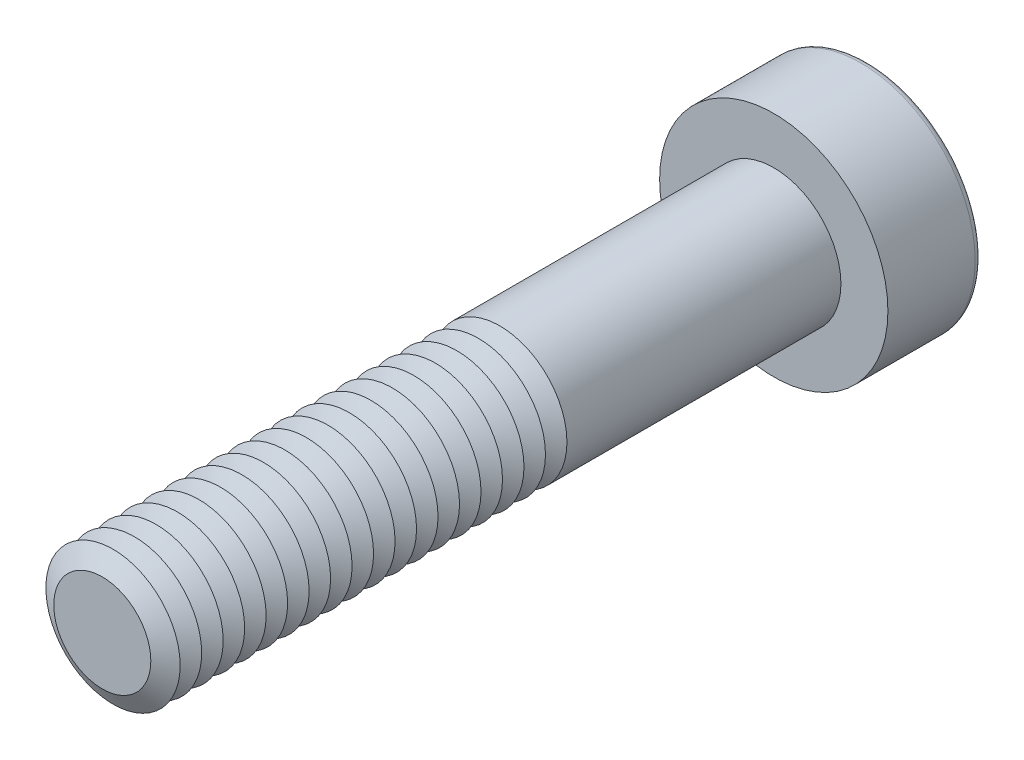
from build123d import *

# Parameters (mm, degrees)
SKETCH1_R           = 2.5
BOSS_EXTRUDE1_DEPTH = 25
SKETCH2_R           = 4.25
BOSS_EXTRUDE2_DEPTH = 3.5
CUT_EXTRUDE1_DEPTH  = 2.25
FILLET1_R           = 0.25
LPATTERN1_COUNT     = 19
LPATTERN1_PITCH     = 0.8


with BuildPart() as part:
    # Sketch1 → Boss-Extrude1 (new body)
    with BuildSketch(Plane.XY):
        Circle(SKETCH1_R)
    extrude(amount=BOSS_EXTRUDE1_DEPTH)

    # Sketch2 → Boss-Extrude2 (add)
    with BuildSketch(Plane(origin=(0, 0, 0), x_dir=(-1, 0, 0), z_dir=(0, 0, -1))):
        Circle(SKETCH2_R)
    extrude(amount=BOSS_EXTRUDE2_DEPTH)

    # Sketch3 → Cut-Extrude1 (cut)
    with BuildSketch(Plane(origin=(0, 0, -3.5), x_dir=(-1, 0, 0), z_dir=(0, 0, -1))):
        Polygon((-0.866025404, 1.5), (-1.732050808, 0), (-0.866025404, -1.5), (0.866025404, -1.5), (1.732050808, 0), (0.866025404, 1.5), align=None)
    extrude(amount=-CUT_EXTRUDE1_DEPTH, mode=Mode.SUBTRACT)

    # Fillet1
    fillet1_edges = [part.edges().sort_by_distance(p)[0] for p in [
        (4.25, 0, -3.5),
    ]]
    fillet(fillet1_edges, radius=FILLET1_R)

    # Cut-Extrude2 cone 1 section (on through the dimple's axis) → Cut-Extrude2 (revolve, cut)
    with BuildSketch(Plane(origin=(0, 0, -1.25), x_dir=(0, 1, 0), z_dir=(1, 0, 0))):
        Polygon((0, 0), (1.5, 0), (0, 0.866025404), align=None)
    revolve(axis=Axis((0, 0, -1.25), (0, 0, 1)), mode=Mode.SUBTRACT)

    # Cut-Extrude3 cone 1 section (on through the dimple's axis) → Cut-Extrude3 (revolve, cut)
    with BuildSketch(Plane(origin=(0, 0, -3.5), x_dir=(0, 1, 0), z_dir=(1, 0, 0))):
        Polygon((0, 0), (1.732050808, 0), (0, 0.464101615), align=None)
    revolve(axis=Axis((0, 0, -3.5), (0, 0, 1)), mode=Mode.SUBTRACT)

    # Sketch7 → Cut-Revolve1 (revolve, cut)
    with BuildSketch(Plane(origin=(0, 0, 0), x_dir=(0, 0, -1), z_dir=(1, 0, 0)), mode=Mode.PRIVATE) as cut_revolve1_sk:
        Polygon((-25, 1.807179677), (-24.6, 2.5), (-25.4, 2.5), align=None)
    cut_revolve1 = revolve(cut_revolve1_sk.sketch.rotate(Axis((0, 0, 25), (0, 0, -1)), 90), axis=Axis((0, 0, 25), (0, 0, -1)), mode=Mode.SUBTRACT)

    # LPattern1: Cut-Revolve1 ×19
    with Locations(*[(0, 0, -i * LPATTERN1_PITCH) for i in range(1, LPATTERN1_COUNT)]):
        add(cut_revolve1, mode=Mode.SUBTRACT)


solid = part.part
